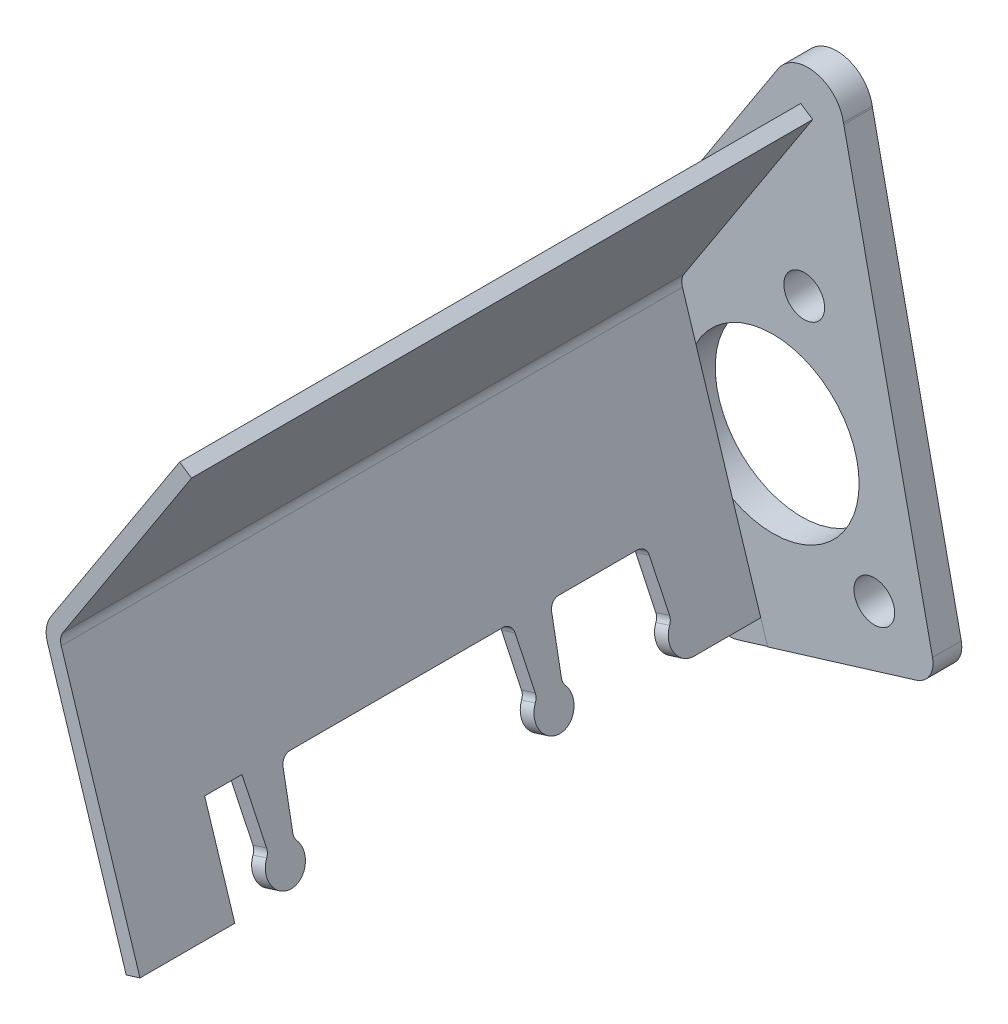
from build123d import *

# Parameters (mm, degrees)
ESQUISSE1_R             = 4.25
EXTRUSION2_DEPTH        = 6
EXTRUSION3_DEPTH        = 129.5
ENL_V_MAT_EXTRU_1_DEPTH = 161.926101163
ESQUISSE7_R             = 18
ENL_V_MAT_EXTRU_2_DEPTH = 152.238702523


with BuildPart() as part:
    # Esquisse1 → Extrusion2 (new body)
    with BuildSketch(Plane.XY):
        with BuildLine():
            Line((-6.820996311, -40.51565536), (30.5630466, -29.086206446))
            ThreePointArc((30.5630466, -29.086206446), (33.413084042, -26.844882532), (33.99906453, -23.266772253))
            Line((33.99906453, -23.266772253), (15.506551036, 63.733663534))
            ThreePointArc((15.506551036, 63.733663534), (15.474292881, 63.876797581), (15.438544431, 64.019100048))
            ThreePointArc((15.438544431, 64.019100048), (9.568987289, 70.124824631), (1.751235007, 66.866861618))
            Line((1.751235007, 66.866861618), (-26.231141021, 23.777781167))
            ThreePointArc((-26.231141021, 23.777781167), (-27.049483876, 22.238702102), (-27.58813599, 20.580901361))
            Line((-27.58813599, 20.580901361), (-33.432185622, -4.732458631))
            ThreePointArc((-33.432185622, -4.732458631), (-33.469960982, -9.061086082), (-31.674840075, -13.000119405))
            Line((-31.674840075, -13.000119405), (-12.276032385, -38.743206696))
            ThreePointArc((-12.276032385, -38.743206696), (-9.827939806, -40.489414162), (-6.820996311, -40.51565536))
        make_face()
        with Locations((-23.688484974, -6.981969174)):
            Circle(ESQUISSE1_R, mode=Mode.SUBTRACT)
        with Locations((7.254412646, 28.620517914)):
            Circle(ESQUISSE1_R, mode=Mode.SUBTRACT)
        with Locations((21.872997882, -19.194719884)):
            Circle(ESQUISSE1_R, mode=Mode.SUBTRACT)
    extrude(amount=EXTRUSION2_DEPTH)

    # Esquisse3 → Extrusion3 (add)
    with BuildSketch(Plane.XY.offset(6)):
        with BuildLine():
            Line((6.520749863, 63.023832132), (-20.271761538, 21.766982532))
            ThreePointArc((-20.271761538, 21.766982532), (-21.216299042, 19.339423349), (-21.043052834, 16.740350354))
            Line((-21.043052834, 16.740350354), (-4.598216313, -35.130470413))
            Line((-4.598216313, -35.130470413), (-1.729149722, -34.253308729))
            Line((-1.729149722, -34.253308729), (-18.14421438, 17.523604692))
            ThreePointArc((-18.14421438, 17.523604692), (-18.257406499, 18.832443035), (-17.800502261, 20.064152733))
            Line((-17.800502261, 20.064152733), (9.036761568, 61.389915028))
            Line((9.036761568, 61.389915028), (6.520749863, 63.023832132))
        make_face()
    extrude(amount=EXTRUSION3_DEPTH)

    # Esquisse4 → Enl_v. mat.-Extru.1 (cut, through all)
    with BuildSketch(Plane(origin=(-11.438895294, -3.626523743, 0), x_dir=(0, 0, -1), z_dir=(0.953241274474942, 0.3022103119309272, 0))):
        with BuildLine():
            Line((-5.897117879, -31.859517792), (-19.897117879, -31.859517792))
            ThreePointArc((-19.897117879, -31.859517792), (-23.494477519, -29.608518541), (-23.043010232, -25.389019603))
            ThreePointArc((-23.043010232, -25.389019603), (-22.694121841, -24.707441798), (-22.626912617, -23.944713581))
            Line((-22.626912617, -23.944713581), (-23.708882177, -13.650460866))
            ThreePointArc((-23.708882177, -13.650460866), (-24.359664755, -12.373228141), (-25.697925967, -11.859517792))
            Line((-25.697925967, -11.859517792), (-42.09630979, -11.859517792))
            ThreePointArc((-42.09630979, -11.859517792), (-43.434571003, -12.373228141), (-44.085353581, -13.650460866))
            Line((-44.085353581, -13.650460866), (-45.16732314, -23.944713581))
            ThreePointArc((-45.16732314, -23.944713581), (-45.100113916, -24.707441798), (-44.751225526, -25.389019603))
            ThreePointArc((-44.751225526, -25.389019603), (-47.897117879, -31.859517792), (-51.043010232, -25.389019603))
            ThreePointArc((-51.043010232, -25.389019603), (-50.694121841, -24.707441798), (-50.626912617, -23.944713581))
            Line((-50.626912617, -23.944713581), (-51.708882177, -13.650460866))
            ThreePointArc((-51.708882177, -13.650460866), (-52.359664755, -12.373228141), (-53.697925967, -11.859517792))
            Line((-53.697925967, -11.859517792), (-98.09630979, -11.859517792))
            ThreePointArc((-98.09630979, -11.859517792), (-99.434571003, -12.373228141), (-100.085353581, -13.650460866))
            Line((-100.085353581, -13.650460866), (-101.16732314, -23.944713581))
            ThreePointArc((-101.16732314, -23.944713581), (-101.100113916, -24.707441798), (-100.751225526, -25.389019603))
            ThreePointArc((-100.751225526, -25.389019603), (-103.897117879, -31.859517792), (-107.043010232, -25.389019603))
            ThreePointArc((-107.043010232, -25.389019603), (-106.694121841, -24.707441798), (-106.626912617, -23.944713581))
            Line((-106.626912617, -23.944713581), (-107.953352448, -11.324481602))
            Line((-107.953352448, -11.324481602), (-115.728188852, -11.324481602))
            Line((-115.728188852, -11.324481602), (-115.728188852, -51.424964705))
            Line((-115.728188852, -51.424964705), (-5.897117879, -51.424964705))
            Line((-5.897117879, -51.424964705), (-5.897117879, -31.859517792))
        make_face()
    extrude(amount=-ENL_V_MAT_EXTRU_1_DEPTH, mode=Mode.SUBTRACT)

    # Esquisse7 → Enl_v. mat.-Extru.2 (cut, through all)
    with BuildSketch(Plane.XY.offset(6)):
        with Locations((0.697286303, 0.473509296)):
            Circle(ESQUISSE7_R)
    extrude(amount=-ENL_V_MAT_EXTRU_2_DEPTH, mode=Mode.SUBTRACT)


solid = part.part
